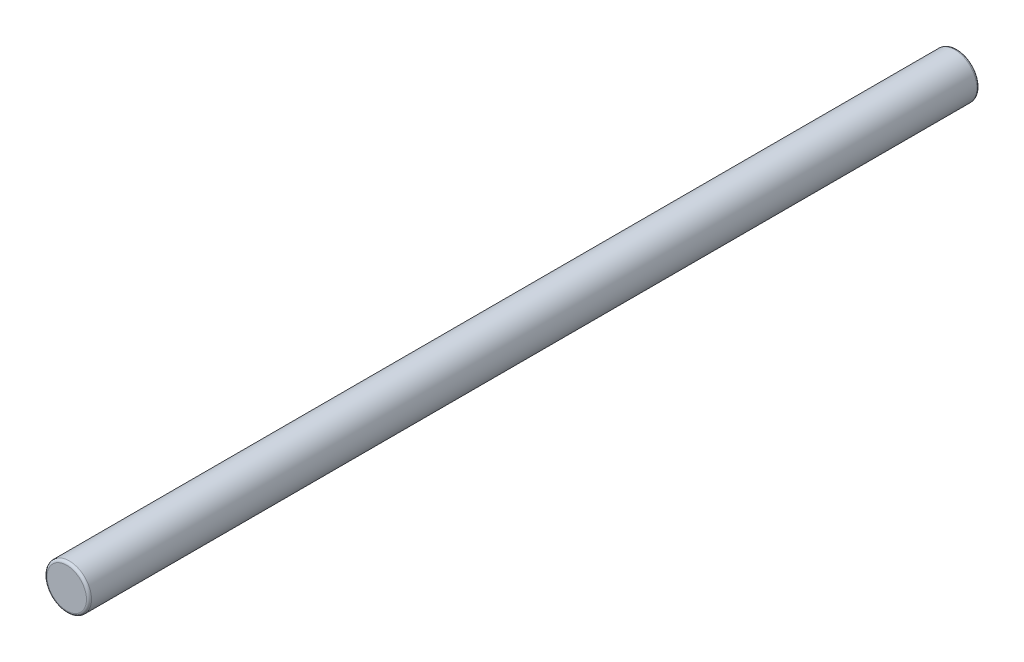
from build123d import *

# Parameters (mm, degrees)
SCHIZZO1_R  = 17.5
RACCORDO1_R = 2


with BuildPart() as part:
    # Sweep1: sweep along a path in Schizzo2
    with BuildLine(Plane(origin=(0, 0, 0), x_dir=(0, 0, -1), z_dir=(1, 0, 0))) as sweep1_path:
        Line((0, 0), (700, 0))
    # Schizzo1 → Sweep1 (sweep)
    with BuildSketch(Plane.XY):
        Circle(SCHIZZO1_R)
    sweep(path=sweep1_path.line)

    # Raccordo1
    raccordo1_edges = [part.edges().sort_by_distance(p)[0] for p in [
        (-17.5, 0, 0),
        (-17.5, 0, -700),
    ]]
    fillet(raccordo1_edges, radius=RACCORDO1_R)


solid = part.part
